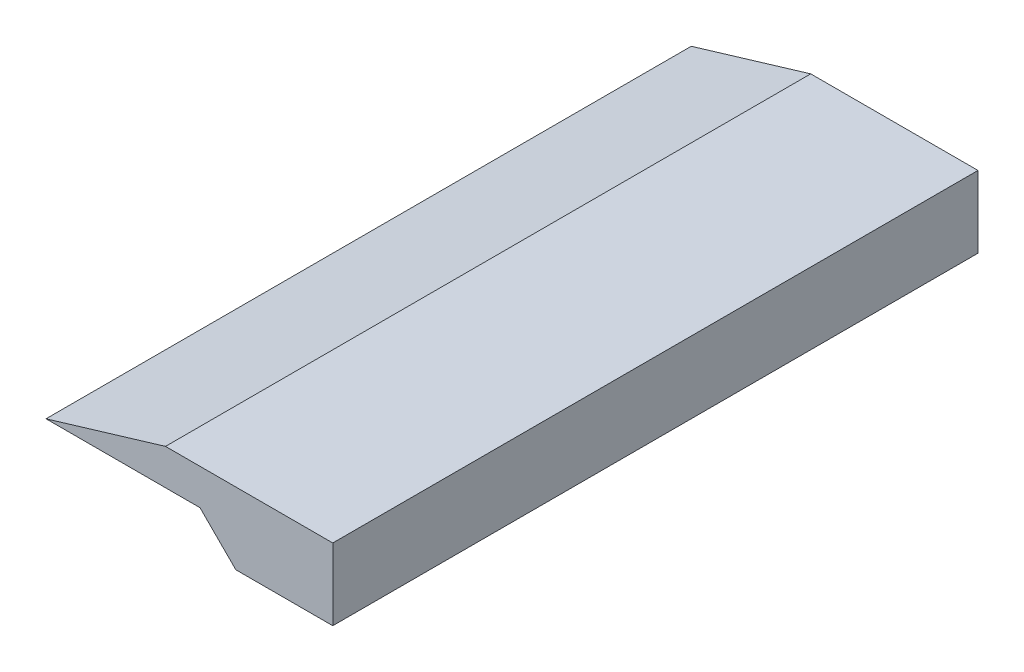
ISO-10303-21;
HEADER;
FILE_DESCRIPTION(('STEP AP214'),'2;1');
FILE_NAME('part.step','',(''),(''),'','','');
FILE_SCHEMA(('AUTOMOTIVE_DESIGN { 1 0 10303 214 1 1 1 1 }'));
ENDSEC;
DATA;
#1=APPLICATION_CONTEXT('core data for automotive mechanical design processes');
#2=APPLICATION_PROTOCOL_DEFINITION('international standard','automotive_design',2000,#1);
#3=PRODUCT_CONTEXT('',#1,'mechanical');
#4=PRODUCT('Part','Part','',(#3));
#5=PRODUCT_RELATED_PRODUCT_CATEGORY('part','',(#4));
#6=PRODUCT_DEFINITION_FORMATION('','',#4);
#7=PRODUCT_DEFINITION_CONTEXT('part definition',#1,'design');
#8=PRODUCT_DEFINITION('design','',#6,#7);
#9=PRODUCT_DEFINITION_SHAPE('','',#8);
#10=(LENGTH_UNIT() NAMED_UNIT(*) SI_UNIT(.MILLI.,.METRE.));
#11=(NAMED_UNIT(*) PLANE_ANGLE_UNIT() SI_UNIT($,.RADIAN.));
#12=(NAMED_UNIT(*) SI_UNIT($,.STERADIAN.) SOLID_ANGLE_UNIT());
#13=UNCERTAINTY_MEASURE_WITH_UNIT(LENGTH_MEASURE(1.E-05),#10,'distance_accuracy_value','');
#14=(GEOMETRIC_REPRESENTATION_CONTEXT(3) GLOBAL_UNCERTAINTY_ASSIGNED_CONTEXT((#13)) GLOBAL_UNIT_ASSIGNED_CONTEXT((#10,
#11,#12)) REPRESENTATION_CONTEXT('',''));
#15=CARTESIAN_POINT('',(0.,0.,0.));
#16=DIRECTION('',(0.,0.,1.));
#17=DIRECTION('',(1.,0.,0.));
#18=AXIS2_PLACEMENT_3D('',#15,#16,#17);
#19=CARTESIAN_POINT('',(-212.13,1.5,-27.));
#20=DIRECTION('',(1.,0.,0.));
#21=DIRECTION('',(0.,0.,-1.));
#22=AXIS2_PLACEMENT_3D('',#19,#20,#21);
#23=PLANE('',#22);
#24=DIRECTION('',(0.,1.,0.));
#25=VECTOR('',#24,1.);
#26=CARTESIAN_POINT('',(-212.13,1.5,0.));
#27=LINE('',#26,#25);
#28=CARTESIAN_POINT('',(-212.13,-1.5,0.));
#29=VERTEX_POINT('',#28);
#30=CARTESIAN_POINT('',(-212.13,1.5,0.));
#31=VERTEX_POINT('',#30);
#32=EDGE_CURVE('E116',#29,#31,#27,.T.);
#33=ORIENTED_EDGE('',*,*,#32,.F.);
#34=DIRECTION('',(0.,0.,1.));
#35=VECTOR('',#34,1.);
#36=CARTESIAN_POINT('',(-212.13,-1.5,-27.));
#37=LINE('',#36,#35);
#38=CARTESIAN_POINT('',(-212.13,-1.5,-27.));
#39=VERTEX_POINT('',#38);
#40=EDGE_CURVE('E11',#39,#29,#37,.T.);
#41=ORIENTED_EDGE('',*,*,#40,.F.);
#42=DIRECTION('',(0.,1.,0.));
#43=VECTOR('',#42,1.);
#44=CARTESIAN_POINT('',(-212.13,1.5,-27.));
#45=LINE('',#44,#43);
#46=CARTESIAN_POINT('',(-212.13,1.5,-27.));
#47=VERTEX_POINT('',#46);
#48=EDGE_CURVE('E107',#39,#47,#45,.T.);
#49=ORIENTED_EDGE('',*,*,#48,.T.);
#50=DIRECTION('',(0.,0.,1.));
#51=VECTOR('',#50,1.);
#52=CARTESIAN_POINT('',(-212.13,1.5,-27.));
#53=LINE('',#52,#51);
#54=EDGE_CURVE('E35',#47,#31,#53,.T.);
#55=ORIENTED_EDGE('',*,*,#54,.T.);
#56=EDGE_LOOP('',(#33,#41,#49,#55));
#57=FACE_BOUND('',#56,.T.);
#58=ADVANCED_FACE('F32',(#57),#23,.T.);
#59=CARTESIAN_POINT('',(-219.13,-1.5,-27.));
#60=DIRECTION('',(0.,-1.,0.));
#61=DIRECTION('',(1.,0.,0.));
#62=AXIS2_PLACEMENT_3D('',#59,#60,#61);
#63=PLANE('',#62);
#64=DIRECTION('',(0.,0.,1.));
#65=VECTOR('',#64,1.);
#66=CARTESIAN_POINT('',(-216.186656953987,-1.5,-27.));
#67=LINE('',#66,#65);
#68=CARTESIAN_POINT('',(-216.186656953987,-1.5,-27.));
#69=VERTEX_POINT('',#68);
#70=CARTESIAN_POINT('',(-216.186656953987,-1.5,0.));
#71=VERTEX_POINT('',#70);
#72=EDGE_CURVE('E48',#69,#71,#67,.T.);
#73=ORIENTED_EDGE('',*,*,#72,.F.);
#74=DIRECTION('',(1.,0.,0.));
#75=VECTOR('',#74,1.);
#76=CARTESIAN_POINT('',(-219.13,-1.5,-27.));
#77=LINE('',#76,#75);
#78=EDGE_CURVE('E55',#69,#39,#77,.T.);
#79=ORIENTED_EDGE('',*,*,#78,.T.);
#80=ORIENTED_EDGE('',*,*,#40,.T.);
#81=DIRECTION('',(1.,0.,0.));
#82=VECTOR('',#81,1.);
#83=CARTESIAN_POINT('',(-219.13,-1.5,0.));
#84=LINE('',#83,#82);
#85=EDGE_CURVE('E73',#71,#29,#84,.T.);
#86=ORIENTED_EDGE('',*,*,#85,.F.);
#87=EDGE_LOOP('',(#73,#79,#80,#86));
#88=FACE_BOUND('',#87,.T.);
#89=ADVANCED_FACE('F102',(#88),#63,.T.);
#90=CARTESIAN_POINT('',(-219.13,1.5,-27.));
#91=DIRECTION('',(-0.287347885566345,0.957826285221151,0.));
#92=DIRECTION('',(-0.957826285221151,-0.287347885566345,0.));
#93=AXIS2_PLACEMENT_3D('',#90,#91,#92);
#94=PLANE('',#93);
#95=DIRECTION('',(-0.957826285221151,-0.287347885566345,0.));
#96=VECTOR('',#95,1.);
#97=CARTESIAN_POINT('',(-219.13,1.5,0.));
#98=LINE('',#97,#96);
#99=CARTESIAN_POINT('',(-219.13,1.5,0.));
#100=VERTEX_POINT('',#99);
#101=CARTESIAN_POINT('',(-224.13,0.,0.));
#102=VERTEX_POINT('',#101);
#103=EDGE_CURVE('E121',#100,#102,#98,.T.);
#104=ORIENTED_EDGE('',*,*,#103,.F.);
#105=DIRECTION('',(0.,0.,1.));
#106=VECTOR('',#105,1.);
#107=CARTESIAN_POINT('',(-219.13,1.5,-27.));
#108=LINE('',#107,#106);
#109=CARTESIAN_POINT('',(-219.13,1.5,-27.));
#110=VERTEX_POINT('',#109);
#111=EDGE_CURVE('E110',#110,#100,#108,.T.);
#112=ORIENTED_EDGE('',*,*,#111,.F.);
#113=DIRECTION('',(-0.957826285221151,-0.287347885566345,0.));
#114=VECTOR('',#113,1.);
#115=CARTESIAN_POINT('',(-219.13,1.5,-27.));
#116=LINE('',#115,#114);
#117=CARTESIAN_POINT('',(-224.13,0.,-27.));
#118=VERTEX_POINT('',#117);
#119=EDGE_CURVE('E108',#110,#118,#116,.T.);
#120=ORIENTED_EDGE('',*,*,#119,.T.);
#121=DIRECTION('',(0.,0.,1.));
#122=VECTOR('',#121,1.);
#123=CARTESIAN_POINT('',(-224.13,0.,-27.));
#124=LINE('',#123,#122);
#125=EDGE_CURVE('E40',#118,#102,#124,.T.);
#126=ORIENTED_EDGE('',*,*,#125,.T.);
#127=EDGE_LOOP('',(#104,#112,#120,#126));
#128=FACE_BOUND('',#127,.T.);
#129=ADVANCED_FACE('F130',(#128),#94,.T.);
#130=CARTESIAN_POINT('',(-212.13,1.5,-27.));
#131=DIRECTION('',(0.,1.,0.));
#132=DIRECTION('',(-1.,0.,0.));
#133=AXIS2_PLACEMENT_3D('',#130,#131,#132);
#134=PLANE('',#133);
#135=DIRECTION('',(-1.,0.,0.));
#136=VECTOR('',#135,1.);
#137=CARTESIAN_POINT('',(-212.13,1.5,0.));
#138=LINE('',#137,#136);
#139=EDGE_CURVE('E118',#31,#100,#138,.T.);
#140=ORIENTED_EDGE('',*,*,#139,.F.);
#141=ORIENTED_EDGE('',*,*,#54,.F.);
#142=DIRECTION('',(-1.,0.,0.));
#143=VECTOR('',#142,1.);
#144=CARTESIAN_POINT('',(-212.13,1.5,-27.));
#145=LINE('',#144,#143);
#146=EDGE_CURVE('E112',#47,#110,#145,.T.);
#147=ORIENTED_EDGE('',*,*,#146,.T.);
#148=ORIENTED_EDGE('',*,*,#111,.T.);
#149=EDGE_LOOP('',(#140,#141,#147,#148));
#150=FACE_BOUND('',#149,.T.);
#151=ADVANCED_FACE('F127',(#150),#134,.T.);
#152=CARTESIAN_POINT('',(-212.13,-1.5,-27.));
#153=DIRECTION('',(0.,0.,1.));
#154=DIRECTION('',(1.,0.,0.));
#155=AXIS2_PLACEMENT_3D('',#152,#153,#154);
#156=PLANE('',#155);
#157=DIRECTION('',(-0.707106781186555,0.70710678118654,0.));
#158=VECTOR('',#157,1.);
#159=CARTESIAN_POINT('',(-217.686656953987,0.,-27.));
#160=LINE('',#159,#158);
#161=CARTESIAN_POINT('',(-217.686656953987,0.,-27.));
#162=VERTEX_POINT('',#161);
#163=EDGE_CURVE('E93',#69,#162,#160,.T.);
#164=ORIENTED_EDGE('',*,*,#163,.T.);
#165=DIRECTION('',(-1.,0.,0.));
#166=VECTOR('',#165,1.);
#167=CARTESIAN_POINT('',(-224.13,0.,-27.));
#168=LINE('',#167,#166);
#169=EDGE_CURVE('E99',#162,#118,#168,.T.);
#170=ORIENTED_EDGE('',*,*,#169,.T.);
#171=ORIENTED_EDGE('',*,*,#119,.F.);
#172=ORIENTED_EDGE('',*,*,#146,.F.);
#173=ORIENTED_EDGE('',*,*,#48,.F.);
#174=ORIENTED_EDGE('',*,*,#78,.F.);
#175=EDGE_LOOP('',(#164,#170,#171,#172,#173,#174));
#176=FACE_BOUND('',#175,.T.);
#177=ADVANCED_FACE('F105',(#176),#156,.F.);
#178=CARTESIAN_POINT('',(-212.13,-1.5,0.));
#179=DIRECTION('',(0.,0.,1.));
#180=DIRECTION('',(1.,0.,0.));
#181=AXIS2_PLACEMENT_3D('',#178,#179,#180);
#182=PLANE('',#181);
#183=DIRECTION('',(-1.,0.,0.));
#184=VECTOR('',#183,1.);
#185=CARTESIAN_POINT('',(-224.13,0.,0.));
#186=LINE('',#185,#184);
#187=CARTESIAN_POINT('',(-217.686656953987,0.,0.));
#188=VERTEX_POINT('',#187);
#189=EDGE_CURVE('E100',#188,#102,#186,.T.);
#190=ORIENTED_EDGE('',*,*,#189,.F.);
#191=DIRECTION('',(-0.707106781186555,0.70710678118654,0.));
#192=VECTOR('',#191,1.);
#193=CARTESIAN_POINT('',(-217.686656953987,0.,0.));
#194=LINE('',#193,#192);
#195=EDGE_CURVE('E139',#71,#188,#194,.T.);
#196=ORIENTED_EDGE('',*,*,#195,.F.);
#197=ORIENTED_EDGE('',*,*,#85,.T.);
#198=ORIENTED_EDGE('',*,*,#32,.T.);
#199=ORIENTED_EDGE('',*,*,#139,.T.);
#200=ORIENTED_EDGE('',*,*,#103,.T.);
#201=EDGE_LOOP('',(#190,#196,#197,#198,#199,#200));
#202=FACE_BOUND('',#201,.T.);
#203=ADVANCED_FACE('F132',(#202),#182,.T.);
#204=CARTESIAN_POINT('',(-224.13,0.,-27.));
#205=DIRECTION('',(0.,1.,0.));
#206=DIRECTION('',(0.,0.,1.));
#207=AXIS2_PLACEMENT_3D('',#204,#205,#206);
#208=PLANE('',#207);
#209=ORIENTED_EDGE('',*,*,#189,.T.);
#210=ORIENTED_EDGE('',*,*,#125,.F.);
#211=ORIENTED_EDGE('',*,*,#169,.F.);
#212=DIRECTION('',(0.,0.,1.));
#213=VECTOR('',#212,1.);
#214=CARTESIAN_POINT('',(-217.686656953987,0.,-27.));
#215=LINE('',#214,#213);
#216=EDGE_CURVE('E95',#162,#188,#215,.T.);
#217=ORIENTED_EDGE('',*,*,#216,.T.);
#218=EDGE_LOOP('',(#209,#210,#211,#217));
#219=FACE_BOUND('',#218,.T.);
#220=ADVANCED_FACE('F142',(#219),#208,.F.);
#221=CARTESIAN_POINT('',(-217.686656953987,0.,-27.));
#222=DIRECTION('',(0.70710678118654,0.707106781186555,0.));
#223=DIRECTION('',(-0.707106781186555,0.70710678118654,0.));
#224=AXIS2_PLACEMENT_3D('',#221,#222,#223);
#225=PLANE('',#224);
#226=ORIENTED_EDGE('',*,*,#195,.T.);
#227=ORIENTED_EDGE('',*,*,#216,.F.);
#228=ORIENTED_EDGE('',*,*,#163,.F.);
#229=ORIENTED_EDGE('',*,*,#72,.T.);
#230=EDGE_LOOP('',(#226,#227,#228,#229));
#231=FACE_BOUND('',#230,.T.);
#232=ADVANCED_FACE('F94',(#231),#225,.F.);
#233=CLOSED_SHELL('',(#58,#89,#129,#151,#177,#203,#220,#232));
#234=MANIFOLD_SOLID_BREP('B2',#233);
#235=ADVANCED_BREP_SHAPE_REPRESENTATION('',(#18,#234),#14);
#236=SHAPE_DEFINITION_REPRESENTATION(#9,#235);
ENDSEC;
END-ISO-10303-21;
